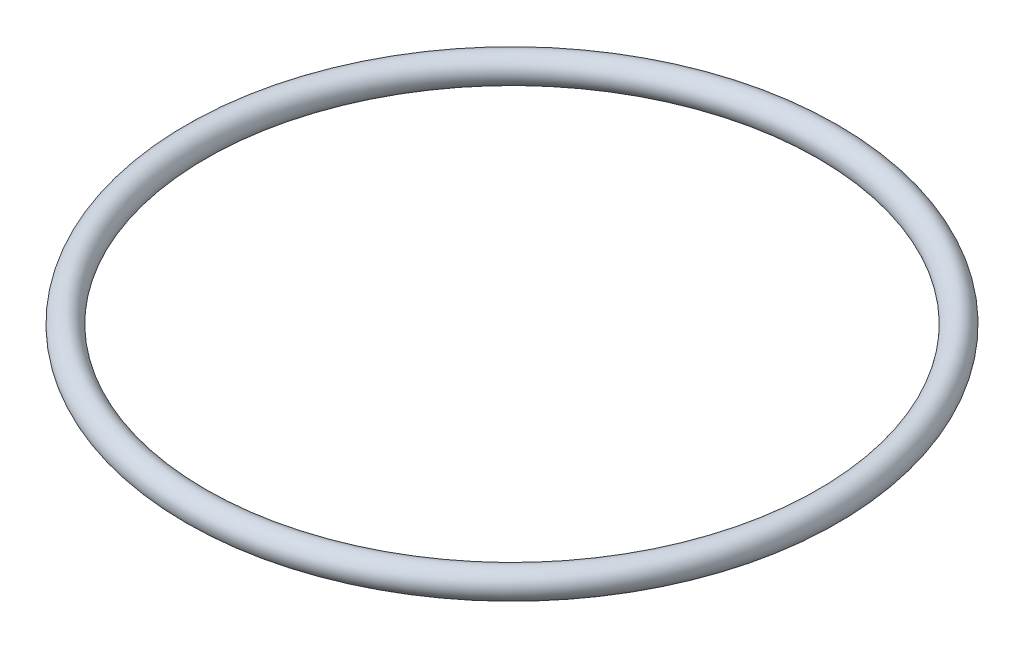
ISO-10303-21;
HEADER;
FILE_DESCRIPTION(('STEP AP214'),'2;1');
FILE_NAME('part.step','',(''),(''),'','','');
FILE_SCHEMA(('AUTOMOTIVE_DESIGN { 1 0 10303 214 1 1 1 1 }'));
ENDSEC;
DATA;
#1=APPLICATION_CONTEXT('core data for automotive mechanical design processes');
#2=APPLICATION_PROTOCOL_DEFINITION('international standard','automotive_design',2000,#1);
#3=PRODUCT_CONTEXT('',#1,'mechanical');
#4=PRODUCT('Part','Part','',(#3));
#5=PRODUCT_RELATED_PRODUCT_CATEGORY('part','',(#4));
#6=PRODUCT_DEFINITION_FORMATION('','',#4);
#7=PRODUCT_DEFINITION_CONTEXT('part definition',#1,'design');
#8=PRODUCT_DEFINITION('design','',#6,#7);
#9=PRODUCT_DEFINITION_SHAPE('','',#8);
#10=(LENGTH_UNIT() NAMED_UNIT(*) SI_UNIT(.MILLI.,.METRE.));
#11=(NAMED_UNIT(*) PLANE_ANGLE_UNIT() SI_UNIT($,.RADIAN.));
#12=(NAMED_UNIT(*) SI_UNIT($,.STERADIAN.) SOLID_ANGLE_UNIT());
#13=UNCERTAINTY_MEASURE_WITH_UNIT(LENGTH_MEASURE(1.E-05),#10,'distance_accuracy_value','');
#14=(GEOMETRIC_REPRESENTATION_CONTEXT(3) GLOBAL_UNCERTAINTY_ASSIGNED_CONTEXT((#13)) GLOBAL_UNIT_ASSIGNED_CONTEXT((#10,
#11,#12)) REPRESENTATION_CONTEXT('',''));
#15=CARTESIAN_POINT('',(0.,0.,0.));
#16=DIRECTION('',(0.,0.,1.));
#17=DIRECTION('',(1.,0.,0.));
#18=AXIS2_PLACEMENT_3D('',#15,#16,#17);
#19=CARTESIAN_POINT('',(0.,0.,0.));
#20=DIRECTION('',(0.,1.,0.));
#21=DIRECTION('',(0.,0.,1.));
#22=AXIS2_PLACEMENT_3D('',#19,#20,#21);
#23=TOROIDAL_SURFACE('',#22,34.5,1.5);
#24=CARTESIAN_POINT('',(0.,0.,36.));
#25=VERTEX_POINT('',#24);
#26=VERTEX_LOOP('',#25);
#27=FACE_BOUND('',#26,.T.);
#28=ADVANCED_FACE('F32',(#27),#23,.T.);
#29=CLOSED_SHELL('',(#28));
#30=MANIFOLD_SOLID_BREP('B2',#29);
#31=ADVANCED_BREP_SHAPE_REPRESENTATION('',(#18,#30),#14);
#32=SHAPE_DEFINITION_REPRESENTATION(#9,#31);
ENDSEC;
END-ISO-10303-21;
